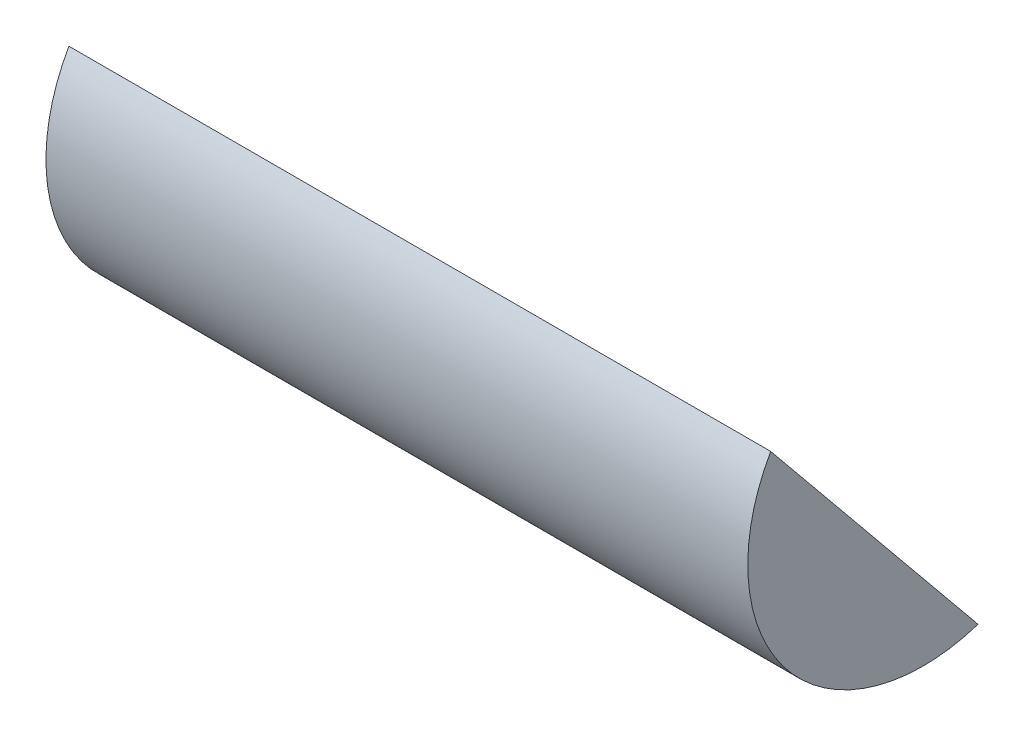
ISO-10303-21;
HEADER;
FILE_DESCRIPTION(('STEP AP214'),'2;1');
FILE_NAME('part.step','',(''),(''),'','','');
FILE_SCHEMA(('AUTOMOTIVE_DESIGN { 1 0 10303 214 1 1 1 1 }'));
ENDSEC;
DATA;
#1=APPLICATION_CONTEXT('core data for automotive mechanical design processes');
#2=APPLICATION_PROTOCOL_DEFINITION('international standard','automotive_design',2000,#1);
#3=PRODUCT_CONTEXT('',#1,'mechanical');
#4=PRODUCT('Part','Part','',(#3));
#5=PRODUCT_RELATED_PRODUCT_CATEGORY('part','',(#4));
#6=PRODUCT_DEFINITION_FORMATION('','',#4);
#7=PRODUCT_DEFINITION_CONTEXT('part definition',#1,'design');
#8=PRODUCT_DEFINITION('design','',#6,#7);
#9=PRODUCT_DEFINITION_SHAPE('','',#8);
#10=(LENGTH_UNIT() NAMED_UNIT(*) SI_UNIT(.MILLI.,.METRE.));
#11=(NAMED_UNIT(*) PLANE_ANGLE_UNIT() SI_UNIT($,.RADIAN.));
#12=(NAMED_UNIT(*) SI_UNIT($,.STERADIAN.) SOLID_ANGLE_UNIT());
#13=UNCERTAINTY_MEASURE_WITH_UNIT(LENGTH_MEASURE(1.E-05),#10,'distance_accuracy_value','');
#14=(GEOMETRIC_REPRESENTATION_CONTEXT(3) GLOBAL_UNCERTAINTY_ASSIGNED_CONTEXT((#13)) GLOBAL_UNIT_ASSIGNED_CONTEXT((#10,
#11,#12)) REPRESENTATION_CONTEXT('',''));
#15=CARTESIAN_POINT('',(0.,0.,0.));
#16=DIRECTION('',(0.,0.,1.));
#17=DIRECTION('',(1.,0.,0.));
#18=AXIS2_PLACEMENT_3D('',#15,#16,#17);
#19=CARTESIAN_POINT('',(-63.5,-21.9252238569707,131.254930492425));
#20=DIRECTION('',(1.,0.,0.));
#21=DIRECTION('',(0.,1.,0.));
#22=AXIS2_PLACEMENT_3D('',#19,#20,#21);
#23=PLANE('',#22);
#24=DIRECTION('',(0.,0.77399079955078,0.633196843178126));
#25=VECTOR('',#24,1.);
#26=CARTESIAN_POINT('',(-63.5,-127.493827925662,137.467228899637));
#27=LINE('',#26,#25);
#28=CARTESIAN_POINT('',(-63.5,-150.420391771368,118.711156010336));
#29=VERTEX_POINT('',#28);
#30=CARTESIAN_POINT('',(-63.5,-104.567264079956,156.223301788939));
#31=VERTEX_POINT('',#30);
#32=EDGE_CURVE('E62',#29,#31,#27,.T.);
#33=ORIENTED_EDGE('',*,*,#32,.F.);
#34=CARTESIAN_POINT('',(-63.5,-120.256388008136,128.620514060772));
#35=DIRECTION('',(1.,0.,0.));
#36=DIRECTION('',(0.,0.,-1.));
#37=AXIS2_PLACEMENT_3D('',#34,#35,#36);
#38=CIRCLE('',#37,31.75);
#39=EDGE_CURVE('E25',#31,#29,#38,.T.);
#40=ORIENTED_EDGE('',*,*,#39,.F.);
#41=EDGE_LOOP('',(#33,#40));
#42=FACE_BOUND('',#41,.T.);
#43=ADVANCED_FACE('F17',(#42),#23,.F.);
#44=CARTESIAN_POINT('',(63.5,-21.9252238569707,131.254930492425));
#45=DIRECTION('',(1.,0.,0.));
#46=DIRECTION('',(0.,1.,0.));
#47=AXIS2_PLACEMENT_3D('',#44,#45,#46);
#48=PLANE('',#47);
#49=DIRECTION('',(0.,0.77399079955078,0.633196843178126));
#50=VECTOR('',#49,1.);
#51=CARTESIAN_POINT('',(63.5,-127.493827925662,137.467228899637));
#52=LINE('',#51,#50);
#53=CARTESIAN_POINT('',(63.5,-150.420391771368,118.711156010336));
#54=VERTEX_POINT('',#53);
#55=CARTESIAN_POINT('',(63.5,-104.567264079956,156.223301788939));
#56=VERTEX_POINT('',#55);
#57=EDGE_CURVE('E63',#54,#56,#52,.T.);
#58=ORIENTED_EDGE('',*,*,#57,.T.);
#59=CARTESIAN_POINT('',(63.5,-120.256388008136,128.620514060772));
#60=DIRECTION('',(1.,0.,0.));
#61=DIRECTION('',(0.,0.,-1.));
#62=AXIS2_PLACEMENT_3D('',#59,#60,#61);
#63=CIRCLE('',#62,31.75);
#64=EDGE_CURVE('E11',#56,#54,#63,.T.);
#65=ORIENTED_EDGE('',*,*,#64,.T.);
#66=EDGE_LOOP('',(#58,#65));
#67=FACE_BOUND('',#66,.T.);
#68=ADVANCED_FACE('F73',(#67),#48,.T.);
#69=CARTESIAN_POINT('',(63.5,-120.256388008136,128.620514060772));
#70=DIRECTION('',(-1.,0.,0.));
#71=DIRECTION('',(0.,0.,1.));
#72=AXIS2_PLACEMENT_3D('',#69,#70,#71);
#73=CYLINDRICAL_SURFACE('',#72,31.75);
#74=ORIENTED_EDGE('',*,*,#39,.T.);
#75=DIRECTION('',(-1.,0.,0.));
#76=VECTOR('',#75,1.);
#77=CARTESIAN_POINT('',(63.5,-150.420391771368,118.711156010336));
#78=LINE('',#77,#76);
#79=EDGE_CURVE('E51',#54,#29,#78,.T.);
#80=ORIENTED_EDGE('',*,*,#79,.F.);
#81=ORIENTED_EDGE('',*,*,#64,.F.);
#82=DIRECTION('',(-1.,0.,0.));
#83=VECTOR('',#82,1.);
#84=CARTESIAN_POINT('',(63.5,-104.567264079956,156.223301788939));
#85=LINE('',#84,#83);
#86=EDGE_CURVE('E54',#56,#31,#85,.T.);
#87=ORIENTED_EDGE('',*,*,#86,.T.);
#88=EDGE_LOOP('',(#74,#80,#81,#87));
#89=FACE_BOUND('',#88,.T.);
#90=ADVANCED_FACE('F50',(#89),#73,.T.);
#91=CARTESIAN_POINT('',(63.5,-127.493827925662,137.467228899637));
#92=DIRECTION('',(0.,-0.633196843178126,0.77399079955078));
#93=DIRECTION('',(-1.,0.,0.));
#94=AXIS2_PLACEMENT_3D('',#91,#92,#93);
#95=PLANE('',#94);
#96=ORIENTED_EDGE('',*,*,#32,.T.);
#97=ORIENTED_EDGE('',*,*,#86,.F.);
#98=ORIENTED_EDGE('',*,*,#57,.F.);
#99=ORIENTED_EDGE('',*,*,#79,.T.);
#100=EDGE_LOOP('',(#96,#97,#98,#99));
#101=FACE_BOUND('',#100,.T.);
#102=ADVANCED_FACE('F61',(#101),#95,.F.);
#103=CLOSED_SHELL('',(#43,#68,#90,#102));
#104=MANIFOLD_SOLID_BREP('B1',#103);
#105=ADVANCED_BREP_SHAPE_REPRESENTATION('',(#18,#104),#14);
#106=SHAPE_DEFINITION_REPRESENTATION(#9,#105);
ENDSEC;
END-ISO-10303-21;
